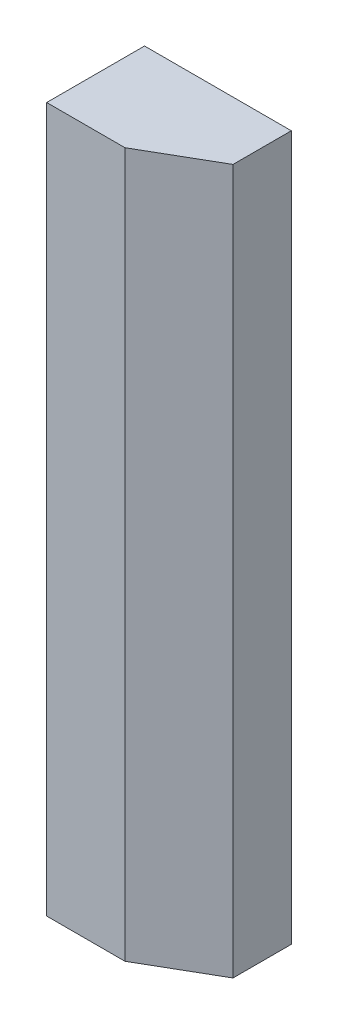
from build123d import *

# Parameters (mm, degrees)
BOSS_EXTRU_1_DEPTH = 144


with BuildPart() as part:
    # Esquisse1 → Boss.-Extru.1 (new body)
    with BuildSketch(Plane(origin=(0, 0, 0), x_dir=(1, 0, 0), z_dir=(0, 1, 0))):
        with BuildLine():
            Line((-15, 10), (-15, 2))
            ThreePointArc((-15, 2), (-7.944271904, 7.888543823), (1.000000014, 10))
            Line((1.000000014, 10), (-15, 10))
        make_face()
        with BuildLine():
            ThreePointArc((1.000000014, 10), (8.561179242, 8.515630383), (15, 4.282856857))
            Line((15, 4.282856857), (15, 10))
            Line((15, 10), (1.000000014, 10))
        make_face()
        with BuildLine():
            Line((-15, -10), (1, -10))
            Line((1, -10), (15, -1.917096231))
            Line((15, -1.917096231), (15, 4.282856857))
            ThreePointArc((15, 4.282856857), (8.561179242, 8.515630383), (1.000000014, 10))
            ThreePointArc((1.000000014, 10), (-7.944271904, 7.888543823), (-15, 2))
            Line((-15, 2), (-15, -10))
        make_face()
    extrude(amount=BOSS_EXTRU_1_DEPTH)


solid = part.part
